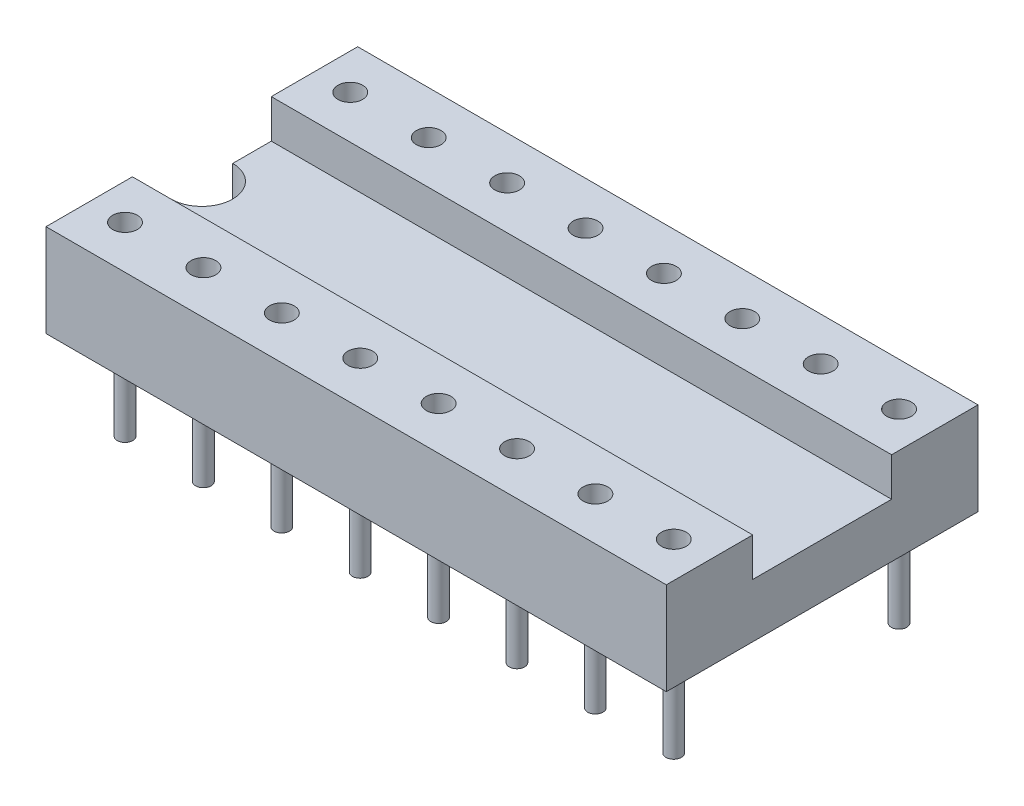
from build123d import *

# Parameters (mm, degrees)
EXTRUSION1_DEPTH        = 20.1
ENL_V_MAT_EXTRU_1_DEPTH = 21.798437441
ESQUISSE3_R             = 0.4
ENL_V_MAT_EXTRU_2_DEPTH = 2.5
ESQUISSE5_R             = 0.25
EXTRUSION2_DEPTH        = 3


with BuildPart() as part:
    # Esquisse1 → Extrusion1 (new body)
    with BuildSketch(Plane(origin=(0, 0, 0), x_dir=(0, 0, -1), z_dir=(1, 0, 0))):
        Polygon((-2.25, 1.75), (-2.25, 3), (-5.05, 3), (-5.05, 0), (5.05, 0), (5.05, 3), (2.25, 3), (2.25, 1.75), align=None)
    extrude(amount=EXTRUSION1_DEPTH)

    # Esquisse2 → Enl_v. mat.-Extru.1 (cut, through all)
    with BuildSketch(Plane(origin=(0, 1.75, 0), x_dir=(-1, 0, 0), z_dir=(0, 1, 0))):
        with BuildLine():
            Line((0, -1), (0, 1))
            ThreePointArc((0, 1), (-1, 0), (0, -1))
        make_face()
    extrude(amount=-ENL_V_MAT_EXTRU_1_DEPTH, mode=Mode.SUBTRACT)

    # Esquisse3 → Enl_v. mat.-Extru.2 (cut)
    with BuildSketch(Plane(origin=(0, 3, 0), x_dir=(-1, 0, 0), z_dir=(0, 1, 0))):
        with Locations(Location((-1.16, 3.65, 0), (0, 0, 90))):
            Circle(ESQUISSE3_R)
        with Locations(Location((-1.16, -3.65, 0), (0, 0, 270))):
            Circle(ESQUISSE3_R)
        with Locations(Location((-3.701, 3.65, 0), (0, 0, 90))):
            Circle(ESQUISSE3_R)
        with Locations(Location((-3.701, -3.65, 0), (0, 0, 270))):
            Circle(ESQUISSE3_R)
        with Locations(Location((-6.242, 3.65, 0), (0, 0, 90))):
            Circle(ESQUISSE3_R)
        with Locations(Location((-6.242, -3.65, 0), (0, 0, 270))):
            Circle(ESQUISSE3_R)
        with Locations(Location((-8.783, 3.65, 0), (0, 0, 90))):
            Circle(ESQUISSE3_R)
        with Locations(Location((-8.783, -3.65, 0), (0, 0, 270))):
            Circle(ESQUISSE3_R)
        with Locations(Location((-11.323, 3.65, 0), (0, 0, 90))):
            Circle(ESQUISSE3_R)
        with Locations(Location((-11.323, -3.65, 0), (0, 0, 270))):
            Circle(ESQUISSE3_R)
        with Locations(Location((-13.863, 3.65, 0), (0, 0, 90))):
            Circle(ESQUISSE3_R)
        with Locations(Location((-13.863, -3.65, 0), (0, 0, 270))):
            Circle(ESQUISSE3_R)
        with Locations(Location((-16.403, 3.65, 0), (0, 0, 90))):
            Circle(ESQUISSE3_R)
        with Locations(Location((-16.403, -3.65, 0), (0, 0, 270))):
            Circle(ESQUISSE3_R)
        with Locations(Location((-18.943, 3.65, 0), (0, 0, 90))):
            Circle(ESQUISSE3_R)
        with Locations(Location((-18.943, -3.65, 0), (0, 0, 270))):
            Circle(ESQUISSE3_R)
    extrude(amount=-ENL_V_MAT_EXTRU_2_DEPTH, mode=Mode.SUBTRACT)

    # Esquisse5 → Extrusion2 (add)
    with BuildSketch(Plane.XZ):
        with Locations(Location((1.16, 3.65, 0), (0, 0, 90))):
            Circle(ESQUISSE5_R)
        with Locations(Location((1.16, -3.65, 0), (0, 0, 90))):
            Circle(ESQUISSE5_R)
        with Locations(Location((3.7, -3.65, 0), (0, 0, 90))):
            Circle(ESQUISSE5_R)
        with Locations(Location((3.7, 3.65, 0), (0, 0, 90))):
            Circle(ESQUISSE5_R)
        with Locations(Location((6.24, -3.65, 0), (0, 0, 90))):
            Circle(ESQUISSE5_R)
        with Locations(Location((6.24, 3.65, 0), (0, 0, 90))):
            Circle(ESQUISSE5_R)
        with Locations(Location((8.78, -3.65, 0), (0, 0, 90))):
            Circle(ESQUISSE5_R)
        with Locations(Location((8.78, 3.65, 0), (0, 0, 90))):
            Circle(ESQUISSE5_R)
        with Locations(Location((11.32, -3.65, 0), (0, 0, 90))):
            Circle(ESQUISSE5_R)
        with Locations(Location((11.32, 3.65, 0), (0, 0, 90))):
            Circle(ESQUISSE5_R)
        with Locations(Location((13.86, -3.65, 0), (0, 0, 90))):
            Circle(ESQUISSE5_R)
        with Locations(Location((13.86, 3.65, 0), (0, 0, 90))):
            Circle(ESQUISSE5_R)
        with Locations(Location((16.4, -3.65, 0), (0, 0, 90))):
            Circle(ESQUISSE5_R)
        with Locations(Location((16.4, 3.65, 0), (0, 0, 90))):
            Circle(ESQUISSE5_R)
        with Locations(Location((18.94, -3.65, 0), (0, 0, 90))):
            Circle(ESQUISSE5_R)
        with Locations(Location((18.94, 3.65, 0), (0, 0, 90))):
            Circle(ESQUISSE5_R)
    extrude(amount=EXTRUSION2_DEPTH)


solid = part.part
